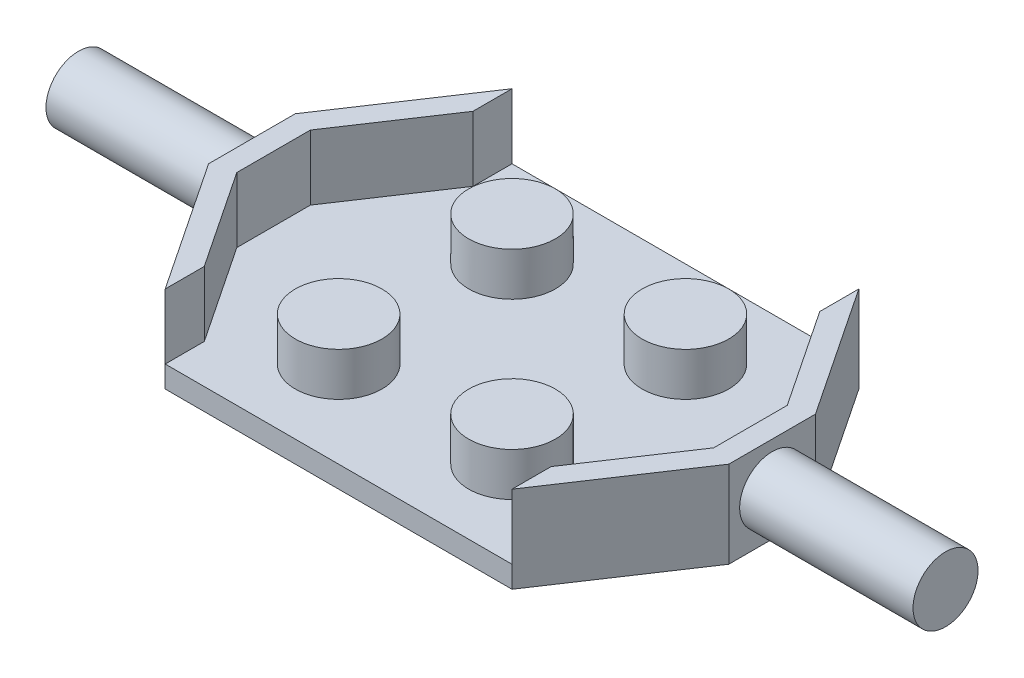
from build123d import *

# Parameters (mm, degrees)
SALIENTE_EXTRUIR1_DEPTH = 1
CROQUIS2_R              = 2
SALIENTE_EXTRUIR2_DEPTH = 2
SALIENTE_EXTRUIR3_DEPTH = 3
CROQUIS4_R              = 1.5
SALIENTE_EXTRUIR4_DEPTH = 8


with BuildPart() as part:
    # Croquis1 → Saliente-Extruir1 (new body)
    with BuildSketch(Plane(origin=(0, 0, 0), x_dir=(1, 0, 0), z_dir=(0, 1, 0))):
        Polygon((-12, -2), (-12, 2), (-8, 8), (0, 8), (0, -8), (-8, -8), align=None)
    saliente_extruir1 = extrude(amount=SALIENTE_EXTRUIR1_DEPTH)

    # Croquis2 → Saliente-Extruir2 (add)
    with BuildSketch(Plane(origin=(0, 1, 0), x_dir=(1, 0, 0), z_dir=(0, 1, 0))):
        with Locations(Location((-4, 4, 0), (0, 0, 90))):
            Circle(CROQUIS2_R)
        with Locations(Location((-4, -4, 0), (0, 0, 90))):
            Circle(CROQUIS2_R)
    saliente_extruir2 = extrude(amount=SALIENTE_EXTRUIR2_DEPTH)

    # Croquis3 → Saliente-Extruir3 (add)
    with BuildSketch(Plane(origin=(0, 1, 0), x_dir=(1, 0, 0), z_dir=(0, 1, 0))):
        Polygon((-11, 1.697224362), (-11, -1.697224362), (-8, -6.197224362), (-8, -8), (-12, -2), (-12, 2), (-8, 8), (-8, 6.197224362), align=None)
    saliente_extruir3 = extrude(amount=SALIENTE_EXTRUIR3_DEPTH)

    # Croquis4 → Saliente-Extruir4 (add)
    with BuildSketch(Plane.ZY.offset(12)):
        with Locations(Location((0, 2, 0), (0, 0, 180))):
            Circle(CROQUIS4_R)
    saliente_extruir4 = extrude(amount=SALIENTE_EXTRUIR4_DEPTH)

    # Simetr_a1: Saliente-Extruir1, Saliente-Extruir2, Saliente-Extruir3, Saliente-Extruir4 across plane
    add(saliente_extruir1.mirror(Plane(origin=(0, 1, -8), x_dir=(0, 0, 1), z_dir=(-1, 0, 0))))
    add(saliente_extruir2.mirror(Plane(origin=(0, 1, -8), x_dir=(0, 0, 1), z_dir=(-1, 0, 0))))
    add(saliente_extruir3.mirror(Plane(origin=(0, 1, -8), x_dir=(0, 0, 1), z_dir=(-1, 0, 0))))
    add(saliente_extruir4.mirror(Plane(origin=(0, 1, -8), x_dir=(0, 0, 1), z_dir=(-1, 0, 0))))


solid = part.part
